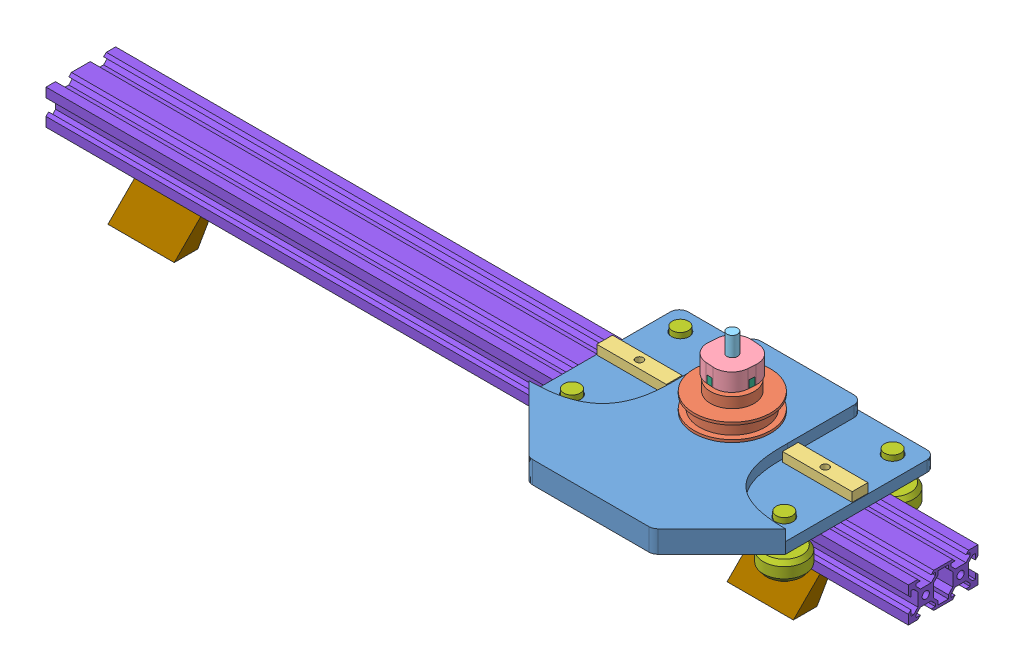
SolidWorks assembly Total Assembly.SLDASM, configuration Default (file format 15000). Lengths in mm.
Overall size (495.3 90.95 129.36).
16 component instances, 9 part files, 5 mates.
Components (placement in the parent):
- Camera Mount Assembly-1: Camera Mount Assembly.SLDASM [Default] at (300.5326 13.081 43.18) size (155.86 75.87 129.36)
  - Camera Adapter w Bearings-1: Camera Adapter w Bearings.SLDPRT [Default] at origin size (147.42 12.75 124.46)
  - Big Pully-1: Big Pully.SLDPRT [Default] at (73.66 12.7 -43.18) x (0.999278 0 -0.037996) z (0.037996 0 0.999278) size (43.94 16.13 43.94)
  - Timing Belt Holder-1: Timing Belt Holder.SLDPRT [Default] at (20.32 6.35 -43.18) size (40 5.33 9.04)
  - Timing Belt Holder-2: Timing Belt Holder.SLDPRT [Default] at (127 6.35 -43.18) size (40 5.33 9.04)
  - Camera to Shaft Adapter-1: Camera to Shaft Adapter.SLDPRT [Glue] at (73.66 37.719 -43.18) x (-0.069479 0 0.997583) z (0.997583 0 0.069479) size (24.38 10.16 24.38)
  - Camera Screw-1: Camera Screw.SLDPRT [Default] at (73.66 35.814 -43.18) x (0.069479 0 -0.997583) z (0.997583 0 0.069479) size (18.03 16.81 18.03)
  - Shaft-1: Shaft.SLDPRT [Default] at (73.66 35.687 -43.18) x (0.069479 0 -0.997583) z (-0.997583 0 -0.069479) size (24.38 35.56 24.38)
  - Bearings-1: Bearings.SLDPRT [Default] at (134.62 9.1948 -12.065) x (0.724268 0 0.689518) z (-0.689518 0 0.724268) size (24 32.44 24)
  - Bearings-2: Bearings.SLDPRT [Default] at (12.7 9.1948 -12.065) x (0.724268 0 0.689518) z (-0.689518 0 0.724268) size (24 32.44 24)
  - Bearings-3: Bearings.SLDPRT [Default] at (134.62 9.1948 -74.295) x (0.724268 0 0.689518) z (-0.689518 0 0.724268) size (24 32.44 24)
  - Bearings-4: Bearings.SLDPRT [Default] at (12.7 9.1948 -74.295) x (0.724268 0 0.689518) z (-0.689518 0 0.724268) size (24 32.44 24)
- Feet Assembly-1: Feet Assembly.SLDASM [Default] at origin size (495.3 35.24 70.48)
  - 2040 Extrusion-1: 2040 Extrusion.SLDPRT [Default] at origin size (495.3 20 40)
  - Feet-1: Feet.SLDPRT [Default] at (406.4 -11.905 0) size (38.1 15.24 70.48)
  - Feet-2: Feet.SLDPRT [Default] at (50.8 -11.905 0) size (38.1 15.24 70.48)
Mates (geometry in assembly coordinates):
- Coincident1: coincident aligned: plane of Feet Assembly-1 through (0 0 0) normal (0 0 1)
- Coincident2: coincident aligned: plane of Feet Assembly-1 through (0 0 0) normal (0 1 0)
- Coincident3: coincident aligned: plane of Feet Assembly-1 through (0 0 0) normal (1 0 0)
- Width1: width anti-aligned: plane of Camera Mount Assembly-1/Timing Belt Holder-2 through (407.5301 24.765 4.5212) normal (0 0 1); plane of Feet Assembly-1/2040 Extrusion-1 through (407.5301 24.765 -4.5212) normal (0 0 -1); plane of Camera Mount Assembly-1/Timing Belt Holder-2 through (495.3 0 -20) normal (0 0 -1); plane of Feet Assembly-1/2040 Extrusion-1 through (495.3 0 20) normal (0 0 1)
- Width2: width aligned: plane of Camera Mount Assembly-1/Bearings-1 through (438.6028 5.461 27.4909) normal (0 1 0); plane of Feet Assembly-1/2040 Extrusion-1 through (442.1581 -5.461 23.7564) normal (0 -1 0); plane of Camera Mount Assembly-1/Bearings-1 through (495.3 10 0) normal (0 1 0); plane of Feet Assembly-1/2040 Extrusion-1 through (495.3 -10 0) normal (0 -1 0)
